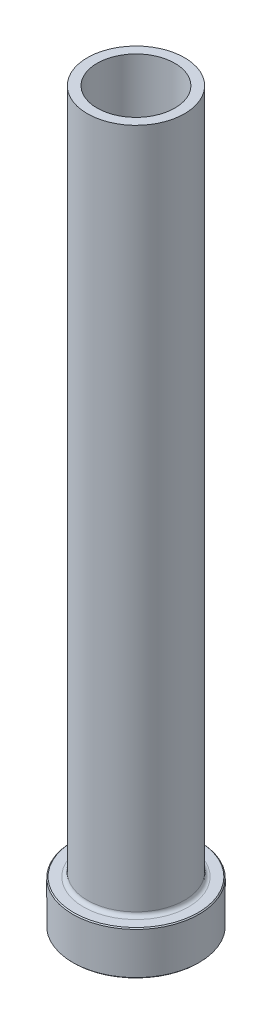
from build123d import *

# Parameters (mm, degrees)
FILLET1_R     = 0.8
CHAMFER1_SIZE = 0.2
CHAMFER3_SIZE = 0.5


with BuildPart() as part:
    # Sketch1 → Revolve1 (revolve)
    with BuildSketch(Plane.XY, mode=Mode.PRIVATE) as revolve1_sk:
        Polygon((-8, 150), (-10, 150), (-10, 9), (-13, 9), (-13, 0), (-8.25, 0), (-8.25, 83), (-8, 95), align=None)
    revolve(revolve1_sk.sketch.rotate(Axis((0, 92.187680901, 0), (0, -1, 0)), 270), axis=Axis((0, 92.187680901, 0), (0, -1, 0)))

    # Fillet1
    fillet1_edges = [part.edges().sort_by_distance(p)[0] for p in [
        (0, 9, -10),
    ]]
    fillet(fillet1_edges, radius=FILLET1_R)

    # Chamfer1
    chamfer1_edges = [part.edges().sort_by_distance(p)[0] for p in [
        (0, 0, -13),
        (0, 9, -13),
    ]]
    chamfer(chamfer1_edges, length=CHAMFER1_SIZE)

    # Chamfer3
    chamfer3_edges = [part.edges().sort_by_distance(p)[0] for p in [
        (0, 0, -8.25),
    ]]
    chamfer(chamfer3_edges, length=CHAMFER3_SIZE)


solid = part.part
